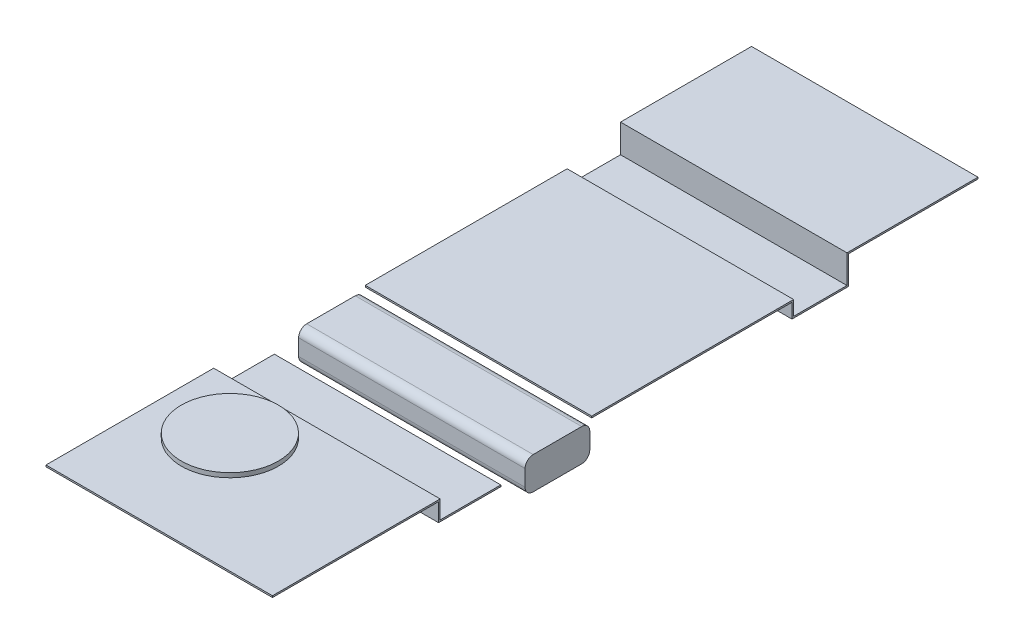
ISO-10303-21;
HEADER;
FILE_DESCRIPTION(('STEP AP214'),'2;1');
FILE_NAME('part.step','',(''),(''),'','','');
FILE_SCHEMA(('AUTOMOTIVE_DESIGN { 1 0 10303 214 1 1 1 1 }'));
ENDSEC;
DATA;
#1=APPLICATION_CONTEXT('core data for automotive mechanical design processes');
#2=APPLICATION_PROTOCOL_DEFINITION('international standard','automotive_design',2000,#1);
#3=PRODUCT_CONTEXT('',#1,'mechanical');
#4=PRODUCT('Part','Part','',(#3));
#5=PRODUCT_RELATED_PRODUCT_CATEGORY('part','',(#4));
#6=PRODUCT_DEFINITION_FORMATION('','',#4);
#7=PRODUCT_DEFINITION_CONTEXT('part definition',#1,'design');
#8=PRODUCT_DEFINITION('design','',#6,#7);
#9=PRODUCT_DEFINITION_SHAPE('','',#8);
#10=(LENGTH_UNIT() NAMED_UNIT(*) SI_UNIT(.MILLI.,.METRE.));
#11=(NAMED_UNIT(*) PLANE_ANGLE_UNIT() SI_UNIT($,.RADIAN.));
#12=(NAMED_UNIT(*) SI_UNIT($,.STERADIAN.) SOLID_ANGLE_UNIT());
#13=UNCERTAINTY_MEASURE_WITH_UNIT(LENGTH_MEASURE(1.E-05),#10,'distance_accuracy_value','');
#14=(GEOMETRIC_REPRESENTATION_CONTEXT(3) GLOBAL_UNCERTAINTY_ASSIGNED_CONTEXT((#13)) GLOBAL_UNIT_ASSIGNED_CONTEXT((#10,
#11,#12)) REPRESENTATION_CONTEXT('',''));
#15=CARTESIAN_POINT('',(0.,0.,0.));
#16=DIRECTION('',(0.,0.,1.));
#17=DIRECTION('',(1.,0.,0.));
#18=AXIS2_PLACEMENT_3D('',#15,#16,#17);
#19=CARTESIAN_POINT('',(-304.8,215.9,-374.65));
#20=DIRECTION('',(0.,1.,0.));
#21=DIRECTION('',(0.,0.,1.));
#22=AXIS2_PLACEMENT_3D('',#19,#20,#21);
#23=PLANE('',#22);
#24=CARTESIAN_POINT('',(-196.85,215.9,-292.1));
#25=DIRECTION('',(0.,1.,0.));
#26=DIRECTION('',(0.,0.,1.));
#27=AXIS2_PLACEMENT_3D('',#24,#25,#26);
#28=CIRCLE('',#27,76.2);
#29=CARTESIAN_POINT('',(-196.85,215.9,-368.3));
#30=VERTEX_POINT('',#29);
#31=EDGE_CURVE('E141',#30,#30,#28,.F.);
#32=ORIENTED_EDGE('',*,*,#31,.T.);
#33=EDGE_LOOP('',(#32));
#34=FACE_BOUND('',#33,.T.);
#35=DIRECTION('',(0.,0.,1.));
#36=VECTOR('',#35,1.);
#37=CARTESIAN_POINT('',(50.8,215.9,-374.65));
#38=LINE('',#37,#36);
#39=CARTESIAN_POINT('',(50.8,215.9,-374.65));
#40=VERTEX_POINT('',#39);
#41=CARTESIAN_POINT('',(50.8,215.9,-111.341361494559));
#42=VERTEX_POINT('',#41);
#43=EDGE_CURVE('E137',#40,#42,#38,.T.);
#44=ORIENTED_EDGE('',*,*,#43,.F.);
#45=DIRECTION('',(1.,0.,0.));
#46=VECTOR('',#45,1.);
#47=CARTESIAN_POINT('',(-304.8,215.9,-374.65));
#48=LINE('',#47,#46);
#49=CARTESIAN_POINT('',(-304.8,215.9,-374.65));
#50=VERTEX_POINT('',#49);
#51=EDGE_CURVE('E12',#50,#40,#48,.T.);
#52=ORIENTED_EDGE('',*,*,#51,.F.);
#53=DIRECTION('',(0.,0.,1.));
#54=VECTOR('',#53,1.);
#55=CARTESIAN_POINT('',(-304.8,215.9,-374.65));
#56=LINE('',#55,#54);
#57=CARTESIAN_POINT('',(-304.8,215.9,-111.341361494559));
#58=VERTEX_POINT('',#57);
#59=EDGE_CURVE('E155',#50,#58,#56,.T.);
#60=ORIENTED_EDGE('',*,*,#59,.T.);
#61=DIRECTION('',(1.,0.,0.));
#62=VECTOR('',#61,1.);
#63=CARTESIAN_POINT('',(-304.8,215.9,-111.341361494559));
#64=LINE('',#63,#62);
#65=EDGE_CURVE('E47',#58,#42,#64,.T.);
#66=ORIENTED_EDGE('',*,*,#65,.T.);
#67=EDGE_LOOP('',(#44,#52,#60,#66));
#68=FACE_BOUND('',#67,.T.);
#69=ADVANCED_FACE('F44',(#34,#68),#23,.T.);
#70=CARTESIAN_POINT('',(-304.8,187.325,-374.65));
#71=DIRECTION('',(0.,0.,-1.));
#72=DIRECTION('',(-1.,0.,0.));
#73=AXIS2_PLACEMENT_3D('',#70,#71,#72);
#74=PLANE('',#73);
#75=DIRECTION('',(0.,1.,0.));
#76=VECTOR('',#75,1.);
#77=CARTESIAN_POINT('',(50.8,187.325,-374.65));
#78=LINE('',#77,#76);
#79=CARTESIAN_POINT('',(50.8,187.325,-374.65));
#80=VERTEX_POINT('',#79);
#81=EDGE_CURVE('E153',#80,#40,#78,.T.);
#82=ORIENTED_EDGE('',*,*,#81,.F.);
#83=DIRECTION('',(1.,0.,0.));
#84=VECTOR('',#83,1.);
#85=CARTESIAN_POINT('',(-304.8,187.325,-374.65));
#86=LINE('',#85,#84);
#87=CARTESIAN_POINT('',(-304.8,187.325,-374.65));
#88=VERTEX_POINT('',#87);
#89=EDGE_CURVE('E53',#88,#80,#86,.T.);
#90=ORIENTED_EDGE('',*,*,#89,.F.);
#91=DIRECTION('',(0.,1.,0.));
#92=VECTOR('',#91,1.);
#93=CARTESIAN_POINT('',(-304.8,187.325,-374.65));
#94=LINE('',#93,#92);
#95=EDGE_CURVE('E132',#88,#50,#94,.T.);
#96=ORIENTED_EDGE('',*,*,#95,.T.);
#97=ORIENTED_EDGE('',*,*,#51,.T.);
#98=EDGE_LOOP('',(#82,#90,#96,#97));
#99=FACE_BOUND('',#98,.T.);
#100=ADVANCED_FACE('F173',(#99),#74,.T.);
#101=CARTESIAN_POINT('',(-304.8,187.325,-469.9));
#102=DIRECTION('',(0.,1.,0.));
#103=DIRECTION('',(0.,0.,1.));
#104=AXIS2_PLACEMENT_3D('',#101,#102,#103);
#105=PLANE('',#104);
#106=DIRECTION('',(0.,0.,1.));
#107=VECTOR('',#106,1.);
#108=CARTESIAN_POINT('',(50.8,187.325,-469.9));
#109=LINE('',#108,#107);
#110=CARTESIAN_POINT('',(50.8,187.325,-469.9));
#111=VERTEX_POINT('',#110);
#112=EDGE_CURVE('E119',#111,#80,#109,.T.);
#113=ORIENTED_EDGE('',*,*,#112,.F.);
#114=DIRECTION('',(1.,0.,0.));
#115=VECTOR('',#114,1.);
#116=CARTESIAN_POINT('',(-304.8,187.325,-469.9));
#117=LINE('',#116,#115);
#118=CARTESIAN_POINT('',(-304.8,187.325,-469.9));
#119=VERTEX_POINT('',#118);
#120=EDGE_CURVE('E113',#119,#111,#117,.T.);
#121=ORIENTED_EDGE('',*,*,#120,.F.);
#122=DIRECTION('',(0.,0.,1.));
#123=VECTOR('',#122,1.);
#124=CARTESIAN_POINT('',(-304.8,187.325,-469.9));
#125=LINE('',#124,#123);
#126=EDGE_CURVE('E117',#119,#88,#125,.T.);
#127=ORIENTED_EDGE('',*,*,#126,.T.);
#128=ORIENTED_EDGE('',*,*,#89,.T.);
#129=EDGE_LOOP('',(#113,#121,#127,#128));
#130=FACE_BOUND('',#129,.T.);
#131=ADVANCED_FACE('F115',(#130),#105,.T.);
#132=CARTESIAN_POINT('',(-304.8,187.325,-469.9));
#133=DIRECTION('',(0.,0.,1.));
#134=DIRECTION('',(1.,0.,0.));
#135=AXIS2_PLACEMENT_3D('',#132,#133,#134);
#136=PLANE('',#135);
#137=DIRECTION('',(0.,-1.,0.));
#138=VECTOR('',#137,1.);
#139=CARTESIAN_POINT('',(50.8,187.325,-469.9));
#140=LINE('',#139,#138);
#141=CARTESIAN_POINT('',(50.8,184.785,-469.9));
#142=VERTEX_POINT('',#141);
#143=EDGE_CURVE('E150',#111,#142,#140,.T.);
#144=ORIENTED_EDGE('',*,*,#143,.T.);
#145=DIRECTION('',(1.,0.,0.));
#146=VECTOR('',#145,1.);
#147=CARTESIAN_POINT('',(-304.8,184.785,-469.9));
#148=LINE('',#147,#146);
#149=CARTESIAN_POINT('',(-304.8,184.785,-469.9));
#150=VERTEX_POINT('',#149);
#151=EDGE_CURVE('E122',#150,#142,#148,.T.);
#152=ORIENTED_EDGE('',*,*,#151,.F.);
#153=DIRECTION('',(0.,-1.,0.));
#154=VECTOR('',#153,1.);
#155=CARTESIAN_POINT('',(-304.8,187.325,-469.9));
#156=LINE('',#155,#154);
#157=EDGE_CURVE('E125',#119,#150,#156,.T.);
#158=ORIENTED_EDGE('',*,*,#157,.F.);
#159=ORIENTED_EDGE('',*,*,#120,.T.);
#160=EDGE_LOOP('',(#144,#152,#158,#159));
#161=FACE_BOUND('',#160,.T.);
#162=ADVANCED_FACE('F126',(#161),#136,.F.);
#163=CARTESIAN_POINT('',(-304.8,184.785,-469.9));
#164=DIRECTION('',(0.,1.,0.));
#165=DIRECTION('',(0.,0.,1.));
#166=AXIS2_PLACEMENT_3D('',#163,#164,#165);
#167=PLANE('',#166);
#168=DIRECTION('',(0.,0.,-1.));
#169=VECTOR('',#168,1.);
#170=CARTESIAN_POINT('',(50.8,184.785,-469.9));
#171=LINE('',#170,#169);
#172=CARTESIAN_POINT('',(50.8,184.785,-372.11));
#173=VERTEX_POINT('',#172);
#174=EDGE_CURVE('E148',#142,#173,#171,.F.);
#175=ORIENTED_EDGE('',*,*,#174,.T.);
#176=DIRECTION('',(1.,0.,0.));
#177=VECTOR('',#176,1.);
#178=CARTESIAN_POINT('',(-304.8,184.785,-372.11));
#179=LINE('',#178,#177);
#180=CARTESIAN_POINT('',(-304.8,184.785,-372.11));
#181=VERTEX_POINT('',#180);
#182=EDGE_CURVE('E159',#181,#173,#179,.T.);
#183=ORIENTED_EDGE('',*,*,#182,.F.);
#184=DIRECTION('',(0.,0.,-1.));
#185=VECTOR('',#184,1.);
#186=CARTESIAN_POINT('',(-304.8,184.785,-469.9));
#187=LINE('',#186,#185);
#188=EDGE_CURVE('E129',#150,#181,#187,.F.);
#189=ORIENTED_EDGE('',*,*,#188,.F.);
#190=ORIENTED_EDGE('',*,*,#151,.T.);
#191=EDGE_LOOP('',(#175,#183,#189,#190));
#192=FACE_BOUND('',#191,.T.);
#193=ADVANCED_FACE('F188',(#192),#167,.F.);
#194=CARTESIAN_POINT('',(-304.8,187.325,-372.11));
#195=DIRECTION('',(0.,0.,-1.));
#196=DIRECTION('',(-1.,0.,0.));
#197=AXIS2_PLACEMENT_3D('',#194,#195,#196);
#198=PLANE('',#197);
#199=DIRECTION('',(0.,1.,0.));
#200=VECTOR('',#199,1.);
#201=CARTESIAN_POINT('',(50.8,187.325,-372.11));
#202=LINE('',#201,#200);
#203=CARTESIAN_POINT('',(50.8,213.36,-372.11));
#204=VERTEX_POINT('',#203);
#205=EDGE_CURVE('E146',#173,#204,#202,.T.);
#206=ORIENTED_EDGE('',*,*,#205,.T.);
#207=DIRECTION('',(1.,0.,0.));
#208=VECTOR('',#207,1.);
#209=CARTESIAN_POINT('',(-304.8,213.36,-372.11));
#210=LINE('',#209,#208);
#211=CARTESIAN_POINT('',(-304.8,213.36,-372.11));
#212=VERTEX_POINT('',#211);
#213=EDGE_CURVE('E162',#212,#204,#210,.T.);
#214=ORIENTED_EDGE('',*,*,#213,.F.);
#215=DIRECTION('',(0.,1.,0.));
#216=VECTOR('',#215,1.);
#217=CARTESIAN_POINT('',(-304.8,187.325,-372.11));
#218=LINE('',#217,#216);
#219=EDGE_CURVE('E229',#181,#212,#218,.T.);
#220=ORIENTED_EDGE('',*,*,#219,.F.);
#221=ORIENTED_EDGE('',*,*,#182,.T.);
#222=EDGE_LOOP('',(#206,#214,#220,#221));
#223=FACE_BOUND('',#222,.T.);
#224=ADVANCED_FACE('F191',(#223),#198,.F.);
#225=CARTESIAN_POINT('',(-304.8,213.36,-374.65));
#226=DIRECTION('',(0.,1.,0.));
#227=DIRECTION('',(0.,0.,1.));
#228=AXIS2_PLACEMENT_3D('',#225,#226,#227);
#229=PLANE('',#228);
#230=DIRECTION('',(0.,0.,-1.));
#231=VECTOR('',#230,1.);
#232=CARTESIAN_POINT('',(50.8,213.36,-374.65));
#233=LINE('',#232,#231);
#234=CARTESIAN_POINT('',(50.8,213.36,-111.341361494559));
#235=VERTEX_POINT('',#234);
#236=EDGE_CURVE('E144',#204,#235,#233,.F.);
#237=ORIENTED_EDGE('',*,*,#236,.T.);
#238=DIRECTION('',(1.,0.,0.));
#239=VECTOR('',#238,1.);
#240=CARTESIAN_POINT('',(-304.8,213.36,-111.341361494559));
#241=LINE('',#240,#239);
#242=CARTESIAN_POINT('',(-304.8,213.36,-111.341361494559));
#243=VERTEX_POINT('',#242);
#244=EDGE_CURVE('E164',#243,#235,#241,.T.);
#245=ORIENTED_EDGE('',*,*,#244,.F.);
#246=DIRECTION('',(0.,0.,-1.));
#247=VECTOR('',#246,1.);
#248=CARTESIAN_POINT('',(-304.8,213.36,-374.65));
#249=LINE('',#248,#247);
#250=EDGE_CURVE('E227',#212,#243,#249,.F.);
#251=ORIENTED_EDGE('',*,*,#250,.F.);
#252=ORIENTED_EDGE('',*,*,#213,.T.);
#253=EDGE_LOOP('',(#237,#245,#251,#252));
#254=FACE_BOUND('',#253,.T.);
#255=ADVANCED_FACE('F195',(#254),#229,.F.);
#256=CARTESIAN_POINT('',(-304.8,213.36,-111.341361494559));
#257=DIRECTION('',(0.,0.,-1.));
#258=DIRECTION('',(-1.,0.,0.));
#259=AXIS2_PLACEMENT_3D('',#256,#257,#258);
#260=PLANE('',#259);
#261=DIRECTION('',(0.,1.,0.));
#262=VECTOR('',#261,1.);
#263=CARTESIAN_POINT('',(50.8,213.36,-111.341361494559));
#264=LINE('',#263,#262);
#265=EDGE_CURVE('E140',#235,#42,#264,.T.);
#266=ORIENTED_EDGE('',*,*,#265,.T.);
#267=ORIENTED_EDGE('',*,*,#65,.F.);
#268=DIRECTION('',(0.,1.,0.));
#269=VECTOR('',#268,1.);
#270=CARTESIAN_POINT('',(-304.8,213.36,-111.341361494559));
#271=LINE('',#270,#269);
#272=EDGE_CURVE('E100',#243,#58,#271,.T.);
#273=ORIENTED_EDGE('',*,*,#272,.F.);
#274=ORIENTED_EDGE('',*,*,#244,.T.);
#275=EDGE_LOOP('',(#266,#267,#273,#274));
#276=FACE_BOUND('',#275,.T.);
#277=ADVANCED_FACE('F169',(#276),#260,.F.);
#278=CARTESIAN_POINT('',(-304.8,0.,0.));
#279=DIRECTION('',(-1.,0.,0.));
#280=DIRECTION('',(0.,0.,1.));
#281=AXIS2_PLACEMENT_3D('',#278,#279,#280);
#282=PLANE('',#281);
#283=ORIENTED_EDGE('',*,*,#59,.F.);
#284=ORIENTED_EDGE('',*,*,#95,.F.);
#285=ORIENTED_EDGE('',*,*,#126,.F.);
#286=ORIENTED_EDGE('',*,*,#157,.T.);
#287=ORIENTED_EDGE('',*,*,#188,.T.);
#288=ORIENTED_EDGE('',*,*,#219,.T.);
#289=ORIENTED_EDGE('',*,*,#250,.T.);
#290=ORIENTED_EDGE('',*,*,#272,.T.);
#291=EDGE_LOOP('',(#283,#284,#285,#286,#287,#288,#289,#290));
#292=FACE_BOUND('',#291,.T.);
#293=ADVANCED_FACE('F131',(#292),#282,.T.);
#294=CARTESIAN_POINT('',(50.8,0.,0.));
#295=DIRECTION('',(-1.,0.,0.));
#296=DIRECTION('',(0.,0.,1.));
#297=AXIS2_PLACEMENT_3D('',#294,#295,#296);
#298=PLANE('',#297);
#299=ORIENTED_EDGE('',*,*,#43,.T.);
#300=ORIENTED_EDGE('',*,*,#265,.F.);
#301=ORIENTED_EDGE('',*,*,#236,.F.);
#302=ORIENTED_EDGE('',*,*,#205,.F.);
#303=ORIENTED_EDGE('',*,*,#174,.F.);
#304=ORIENTED_EDGE('',*,*,#143,.F.);
#305=ORIENTED_EDGE('',*,*,#112,.T.);
#306=ORIENTED_EDGE('',*,*,#81,.T.);
#307=EDGE_LOOP('',(#299,#300,#301,#302,#303,#304,#305,#306));
#308=FACE_BOUND('',#307,.T.);
#309=ADVANCED_FACE('F172',(#308),#298,.F.);
#310=CARTESIAN_POINT('',(-196.85,222.885,-292.1));
#311=DIRECTION('',(0.,-1.,0.));
#312=DIRECTION('',(0.,0.,-1.));
#313=AXIS2_PLACEMENT_3D('',#310,#311,#312);
#314=CYLINDRICAL_SURFACE('',#313,76.2);
#315=CARTESIAN_POINT('',(-196.85,222.885,-292.1));
#316=DIRECTION('',(0.,1.,0.));
#317=DIRECTION('',(0.,0.,1.));
#318=AXIS2_PLACEMENT_3D('',#315,#316,#317);
#319=CIRCLE('',#318,76.2);
#320=CARTESIAN_POINT('',(-196.85,222.885,-368.3));
#321=VERTEX_POINT('',#320);
#322=EDGE_CURVE('E219',#321,#321,#319,.T.);
#323=CARTESIAN_POINT('',(-196.85,215.9,-368.3));
#324=CARTESIAN_POINT('',(-196.85,215.972760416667,-368.3));
#325=CARTESIAN_POINT('',(-196.85,216.045520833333,-368.3));
#326=CARTESIAN_POINT('',(-196.85,216.191041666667,-368.3));
#327=CARTESIAN_POINT('',(-196.85,216.263802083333,-368.3));
#328=CARTESIAN_POINT('',(-196.85,216.409322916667,-368.3));
#329=CARTESIAN_POINT('',(-196.85,216.482083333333,-368.3));
#330=CARTESIAN_POINT('',(-196.85,216.627604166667,-368.3));
#331=CARTESIAN_POINT('',(-196.85,216.700364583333,-368.3));
#332=CARTESIAN_POINT('',(-196.85,216.845885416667,-368.3));
#333=CARTESIAN_POINT('',(-196.85,216.918645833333,-368.3));
#334=CARTESIAN_POINT('',(-196.85,217.064166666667,-368.3));
#335=CARTESIAN_POINT('',(-196.85,217.136927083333,-368.3));
#336=CARTESIAN_POINT('',(-196.85,217.282447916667,-368.3));
#337=CARTESIAN_POINT('',(-196.85,217.355208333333,-368.3));
#338=CARTESIAN_POINT('',(-196.85,217.500729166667,-368.3));
#339=CARTESIAN_POINT('',(-196.85,217.573489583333,-368.3));
#340=CARTESIAN_POINT('',(-196.85,217.719010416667,-368.3));
#341=CARTESIAN_POINT('',(-196.85,217.791770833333,-368.3));
#342=CARTESIAN_POINT('',(-196.85,217.937291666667,-368.3));
#343=CARTESIAN_POINT('',(-196.85,218.010052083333,-368.3));
#344=CARTESIAN_POINT('',(-196.85,218.155572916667,-368.3));
#345=CARTESIAN_POINT('',(-196.85,218.228333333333,-368.3));
#346=CARTESIAN_POINT('',(-196.85,218.373854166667,-368.3));
#347=CARTESIAN_POINT('',(-196.85,218.446614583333,-368.3));
#348=CARTESIAN_POINT('',(-196.85,218.592135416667,-368.3));
#349=CARTESIAN_POINT('',(-196.85,218.664895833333,-368.3));
#350=CARTESIAN_POINT('',(-196.85,218.810416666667,-368.3));
#351=CARTESIAN_POINT('',(-196.85,218.883177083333,-368.3));
#352=CARTESIAN_POINT('',(-196.85,219.028697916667,-368.3));
#353=CARTESIAN_POINT('',(-196.85,219.101458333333,-368.3));
#354=CARTESIAN_POINT('',(-196.85,219.246979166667,-368.3));
#355=CARTESIAN_POINT('',(-196.85,219.319739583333,-368.3));
#356=CARTESIAN_POINT('',(-196.85,219.465260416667,-368.3));
#357=CARTESIAN_POINT('',(-196.85,219.538020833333,-368.3));
#358=CARTESIAN_POINT('',(-196.85,219.683541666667,-368.3));
#359=CARTESIAN_POINT('',(-196.85,219.756302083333,-368.3));
#360=CARTESIAN_POINT('',(-196.85,219.901822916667,-368.3));
#361=CARTESIAN_POINT('',(-196.85,219.974583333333,-368.3));
#362=CARTESIAN_POINT('',(-196.85,220.120104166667,-368.3));
#363=CARTESIAN_POINT('',(-196.85,220.192864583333,-368.3));
#364=CARTESIAN_POINT('',(-196.85,220.338385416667,-368.3));
#365=CARTESIAN_POINT('',(-196.85,220.411145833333,-368.3));
#366=CARTESIAN_POINT('',(-196.85,220.556666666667,-368.3));
#367=CARTESIAN_POINT('',(-196.85,220.629427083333,-368.3));
#368=CARTESIAN_POINT('',(-196.85,220.774947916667,-368.3));
#369=CARTESIAN_POINT('',(-196.85,220.847708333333,-368.3));
#370=CARTESIAN_POINT('',(-196.85,220.993229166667,-368.3));
#371=CARTESIAN_POINT('',(-196.85,221.065989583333,-368.3));
#372=CARTESIAN_POINT('',(-196.85,221.211510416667,-368.3));
#373=CARTESIAN_POINT('',(-196.85,221.284270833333,-368.3));
#374=CARTESIAN_POINT('',(-196.85,221.429791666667,-368.3));
#375=CARTESIAN_POINT('',(-196.85,221.502552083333,-368.3));
#376=CARTESIAN_POINT('',(-196.85,221.648072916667,-368.3));
#377=CARTESIAN_POINT('',(-196.85,221.720833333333,-368.3));
#378=CARTESIAN_POINT('',(-196.85,221.866354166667,-368.3));
#379=CARTESIAN_POINT('',(-196.85,221.939114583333,-368.3));
#380=CARTESIAN_POINT('',(-196.85,222.084635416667,-368.3));
#381=CARTESIAN_POINT('',(-196.85,222.157395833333,-368.3));
#382=CARTESIAN_POINT('',(-196.85,222.302916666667,-368.3));
#383=CARTESIAN_POINT('',(-196.85,222.375677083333,-368.3));
#384=CARTESIAN_POINT('',(-196.85,222.521197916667,-368.3));
#385=CARTESIAN_POINT('',(-196.85,222.593958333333,-368.3));
#386=CARTESIAN_POINT('',(-196.85,222.739479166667,-368.3));
#387=CARTESIAN_POINT('',(-196.85,222.812239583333,-368.3));
#388=CARTESIAN_POINT('',(-196.85,222.885,-368.3));
#389=B_SPLINE_CURVE_WITH_KNOTS('',3,(#323,#324,#325,#326,#327,#328,#329,#330,#331,#332,#333,
#334,#335,#336,#337,#338,#339,#340,#341,#342,#343,#344,#345,#346,#347,#348,#349,#350,#351,#352,
#353,#354,#355,#356,#357,#358,#359,#360,#361,#362,#363,#364,#365,#366,#367,#368,#369,#370,#371,
#372,#373,#374,#375,#376,#377,#378,#379,#380,#381,#382,#383,#384,#385,#386,#387,#388),
.UNSPECIFIED.,.F.,.F.,(4,2,2,2,2,2,2,2,2,2,2,2,2,2,2,2,2,2,2,2,2,2,2,2,2,2,2,2,2,2,2,2,4),(0.,
0.218281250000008,0.436562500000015,0.654843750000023,0.873125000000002,1.09140625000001,
1.30968750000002,1.52796875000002,1.74625,1.96453125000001,2.18281250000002,2.40109375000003,
2.61937500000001,2.83765625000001,3.05593750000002,3.27421875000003,3.49250000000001,
3.71078125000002,3.92906250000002,4.14734375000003,4.36562500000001,4.58390625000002,
4.80218750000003,5.02046875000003,5.23875000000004,5.45703125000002,5.67531250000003,
5.89359375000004,6.11187500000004,6.33015625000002,6.54843750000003,6.76671875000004,
6.98500000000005),.UNSPECIFIED.);
#390=EDGE_CURVE('BSEAM207',#30,#321,#389,.T.);
#391=ORIENTED_EDGE('',*,*,#31,.F.);
#392=ORIENTED_EDGE('',*,*,#322,.F.);
#393=ORIENTED_EDGE('',*,*,#390,.T.);
#394=ORIENTED_EDGE('',*,*,#390,.F.);
#395=EDGE_LOOP('',(#391,#393,#392,#394));
#396=FACE_BOUND('',#395,.T.);
#397=ADVANCED_FACE('F207',(#396),#314,.T.);
#398=CARTESIAN_POINT('',(-196.85,222.885,-292.1));
#399=DIRECTION('',(0.,1.,0.));
#400=DIRECTION('',(0.,0.,1.));
#401=AXIS2_PLACEMENT_3D('',#398,#399,#400);
#402=PLANE('',#401);
#403=ORIENTED_EDGE('',*,*,#322,.T.);
#404=EDGE_LOOP('',(#403));
#405=FACE_BOUND('',#404,.T.);
#406=ADVANCED_FACE('F211',(#405),#402,.T.);
#407=CLOSED_SHELL('',(#69,#100,#131,#162,#193,#224,#255,#277,#293,#309,#397,#406));
#408=MANIFOLD_SOLID_BREP('B2',#407);
#409=CARTESIAN_POINT('',(-304.8,228.6,-1016.));
#410=DIRECTION('',(0.,-1.,0.));
#411=DIRECTION('',(0.,0.,-1.));
#412=AXIS2_PLACEMENT_3D('',#409,#410,#411);
#413=PLANE('',#412);
#414=DIRECTION('',(0.,0.,-1.));
#415=VECTOR('',#414,1.);
#416=CARTESIAN_POINT('',(50.8,228.6,-1016.));
#417=LINE('',#416,#415);
#418=CARTESIAN_POINT('',(50.8,228.6,-1016.));
#419=VERTEX_POINT('',#418);
#420=CARTESIAN_POINT('',(50.8,228.6,-1219.2));
#421=VERTEX_POINT('',#420);
#422=EDGE_CURVE('E430',#419,#421,#417,.T.);
#423=ORIENTED_EDGE('',*,*,#422,.F.);
#424=DIRECTION('',(1.,0.,0.));
#425=VECTOR('',#424,1.);
#426=CARTESIAN_POINT('',(-304.8,228.6,-1016.));
#427=LINE('',#426,#425);
#428=CARTESIAN_POINT('',(-304.8,228.6,-1016.));
#429=VERTEX_POINT('',#428);
#430=EDGE_CURVE('E42',#429,#419,#427,.T.);
#431=ORIENTED_EDGE('',*,*,#430,.F.);
#432=DIRECTION('',(0.,0.,-1.));
#433=VECTOR('',#432,1.);
#434=CARTESIAN_POINT('',(-304.8,228.6,-1016.));
#435=LINE('',#434,#433);
#436=CARTESIAN_POINT('',(-304.8,228.6,-1219.2));
#437=VERTEX_POINT('',#436);
#438=EDGE_CURVE('E456',#429,#437,#435,.T.);
#439=ORIENTED_EDGE('',*,*,#438,.T.);
#440=DIRECTION('',(1.,0.,0.));
#441=VECTOR('',#440,1.);
#442=CARTESIAN_POINT('',(-304.8,228.6,-1219.2));
#443=LINE('',#442,#441);
#444=EDGE_CURVE('E313',#437,#421,#443,.T.);
#445=ORIENTED_EDGE('',*,*,#444,.T.);
#446=EDGE_LOOP('',(#423,#431,#439,#445));
#447=FACE_BOUND('',#446,.T.);
#448=ADVANCED_FACE('F310',(#447),#413,.T.);
#449=CARTESIAN_POINT('',(-304.8,184.15,-1016.));
#450=DIRECTION('',(0.,0.,-1.));
#451=DIRECTION('',(-1.,0.,0.));
#452=AXIS2_PLACEMENT_3D('',#449,#450,#451);
#453=PLANE('',#452);
#454=DIRECTION('',(0.,1.,0.));
#455=VECTOR('',#454,1.);
#456=CARTESIAN_POINT('',(50.8,184.15,-1016.));
#457=LINE('',#456,#455);
#458=CARTESIAN_POINT('',(50.8,184.15,-1016.));
#459=VERTEX_POINT('',#458);
#460=EDGE_CURVE('E454',#459,#419,#457,.T.);
#461=ORIENTED_EDGE('',*,*,#460,.F.);
#462=DIRECTION('',(1.,0.,0.));
#463=VECTOR('',#462,1.);
#464=CARTESIAN_POINT('',(-304.8,184.15,-1016.));
#465=LINE('',#464,#463);
#466=CARTESIAN_POINT('',(-304.8,184.15,-1016.));
#467=VERTEX_POINT('',#466);
#468=EDGE_CURVE('E319',#467,#459,#465,.T.);
#469=ORIENTED_EDGE('',*,*,#468,.F.);
#470=DIRECTION('',(0.,1.,0.));
#471=VECTOR('',#470,1.);
#472=CARTESIAN_POINT('',(-304.8,184.15,-1016.));
#473=LINE('',#472,#471);
#474=EDGE_CURVE('E420',#467,#429,#473,.T.);
#475=ORIENTED_EDGE('',*,*,#474,.T.);
#476=ORIENTED_EDGE('',*,*,#430,.T.);
#477=EDGE_LOOP('',(#461,#469,#475,#476));
#478=FACE_BOUND('',#477,.T.);
#479=ADVANCED_FACE('F485',(#478),#453,.T.);
#480=CARTESIAN_POINT('',(-304.8,184.15,-927.1));
#481=DIRECTION('',(0.,-1.,0.));
#482=DIRECTION('',(0.,0.,-1.));
#483=AXIS2_PLACEMENT_3D('',#480,#481,#482);
#484=PLANE('',#483);
#485=DIRECTION('',(0.,0.,-1.));
#486=VECTOR('',#485,1.);
#487=CARTESIAN_POINT('',(50.8,184.15,-927.1));
#488=LINE('',#487,#486);
#489=CARTESIAN_POINT('',(50.8,184.15,-927.1));
#490=VERTEX_POINT('',#489);
#491=EDGE_CURVE('E408',#490,#459,#488,.T.);
#492=ORIENTED_EDGE('',*,*,#491,.F.);
#493=DIRECTION('',(1.,0.,0.));
#494=VECTOR('',#493,1.);
#495=CARTESIAN_POINT('',(-304.8,184.15,-927.1));
#496=LINE('',#495,#494);
#497=CARTESIAN_POINT('',(-304.8,184.15,-927.1));
#498=VERTEX_POINT('',#497);
#499=EDGE_CURVE('E403',#498,#490,#496,.T.);
#500=ORIENTED_EDGE('',*,*,#499,.F.);
#501=DIRECTION('',(0.,0.,-1.));
#502=VECTOR('',#501,1.);
#503=CARTESIAN_POINT('',(-304.8,184.15,-927.1));
#504=LINE('',#503,#502);
#505=EDGE_CURVE('E406',#498,#467,#504,.T.);
#506=ORIENTED_EDGE('',*,*,#505,.T.);
#507=ORIENTED_EDGE('',*,*,#468,.T.);
#508=EDGE_LOOP('',(#492,#500,#506,#507));
#509=FACE_BOUND('',#508,.T.);
#510=ADVANCED_FACE('F405',(#509),#484,.T.);
#511=CARTESIAN_POINT('',(-304.8,207.01,-927.1));
#512=DIRECTION('',(0.,0.,1.));
#513=DIRECTION('',(1.,0.,0.));
#514=AXIS2_PLACEMENT_3D('',#511,#512,#513);
#515=PLANE('',#514);
#516=DIRECTION('',(0.,-1.,0.));
#517=VECTOR('',#516,1.);
#518=CARTESIAN_POINT('',(50.8,207.01,-927.1));
#519=LINE('',#518,#517);
#520=CARTESIAN_POINT('',(50.8,207.01,-927.1));
#521=VERTEX_POINT('',#520);
#522=EDGE_CURVE('E451',#521,#490,#519,.T.);
#523=ORIENTED_EDGE('',*,*,#522,.F.);
#524=DIRECTION('',(1.,0.,0.));
#525=VECTOR('',#524,1.);
#526=CARTESIAN_POINT('',(-304.8,207.01,-927.1));
#527=LINE('',#526,#525);
#528=CARTESIAN_POINT('',(-304.8,207.01,-927.1));
#529=VERTEX_POINT('',#528);
#530=EDGE_CURVE('E413',#529,#521,#527,.T.);
#531=ORIENTED_EDGE('',*,*,#530,.F.);
#532=DIRECTION('',(0.,-1.,0.));
#533=VECTOR('',#532,1.);
#534=CARTESIAN_POINT('',(-304.8,207.01,-927.1));
#535=LINE('',#534,#533);
#536=EDGE_CURVE('E418',#529,#498,#535,.T.);
#537=ORIENTED_EDGE('',*,*,#536,.T.);
#538=ORIENTED_EDGE('',*,*,#499,.T.);
#539=EDGE_LOOP('',(#523,#531,#537,#538));
#540=FACE_BOUND('',#539,.T.);
#541=ADVANCED_FACE('F422',(#540),#515,.T.);
#542=CARTESIAN_POINT('',(-304.8,207.01,-612.668806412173));
#543=DIRECTION('',(0.,-1.,0.));
#544=DIRECTION('',(0.,0.,-1.));
#545=AXIS2_PLACEMENT_3D('',#542,#543,#544);
#546=PLANE('',#545);
#547=DIRECTION('',(0.,0.,-1.));
#548=VECTOR('',#547,1.);
#549=CARTESIAN_POINT('',(50.8,207.01,-612.668806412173));
#550=LINE('',#549,#548);
#551=CARTESIAN_POINT('',(50.8,207.01,-612.668806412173));
#552=VERTEX_POINT('',#551);
#553=EDGE_CURVE('E448',#552,#521,#550,.T.);
#554=ORIENTED_EDGE('',*,*,#553,.F.);
#555=DIRECTION('',(1.,0.,0.));
#556=VECTOR('',#555,1.);
#557=CARTESIAN_POINT('',(-304.8,207.01,-612.668806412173));
#558=LINE('',#557,#556);
#559=CARTESIAN_POINT('',(-304.8,207.01,-612.668806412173));
#560=VERTEX_POINT('',#559);
#561=EDGE_CURVE('E460',#560,#552,#558,.T.);
#562=ORIENTED_EDGE('',*,*,#561,.F.);
#563=DIRECTION('',(0.,0.,-1.));
#564=VECTOR('',#563,1.);
#565=CARTESIAN_POINT('',(-304.8,207.01,-612.668806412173));
#566=LINE('',#565,#564);
#567=EDGE_CURVE('E423',#560,#529,#566,.T.);
#568=ORIENTED_EDGE('',*,*,#567,.T.);
#569=ORIENTED_EDGE('',*,*,#530,.T.);
#570=EDGE_LOOP('',(#554,#562,#568,#569));
#571=FACE_BOUND('',#570,.T.);
#572=ADVANCED_FACE('F498',(#571),#546,.T.);
#573=CARTESIAN_POINT('',(-304.8,207.01,-612.668806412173));
#574=DIRECTION('',(0.,0.,-1.));
#575=DIRECTION('',(-1.,0.,0.));
#576=AXIS2_PLACEMENT_3D('',#573,#574,#575);
#577=PLANE('',#576);
#578=DIRECTION('',(0.,1.,0.));
#579=VECTOR('',#578,1.);
#580=CARTESIAN_POINT('',(50.8,207.01,-612.668806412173));
#581=LINE('',#580,#579);
#582=CARTESIAN_POINT('',(50.8,209.55,-612.668806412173));
#583=VERTEX_POINT('',#582);
#584=EDGE_CURVE('E446',#552,#583,#581,.T.);
#585=ORIENTED_EDGE('',*,*,#584,.T.);
#586=DIRECTION('',(1.,0.,0.));
#587=VECTOR('',#586,1.);
#588=CARTESIAN_POINT('',(-304.8,209.55,-612.668806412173));
#589=LINE('',#588,#587);
#590=CARTESIAN_POINT('',(-304.8,209.55,-612.668806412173));
#591=VERTEX_POINT('',#590);
#592=EDGE_CURVE('E462',#591,#583,#589,.T.);
#593=ORIENTED_EDGE('',*,*,#592,.F.);
#594=DIRECTION('',(0.,1.,0.));
#595=VECTOR('',#594,1.);
#596=CARTESIAN_POINT('',(-304.8,207.01,-612.668806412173));
#597=LINE('',#596,#595);
#598=EDGE_CURVE('E425',#560,#591,#597,.T.);
#599=ORIENTED_EDGE('',*,*,#598,.F.);
#600=ORIENTED_EDGE('',*,*,#561,.T.);
#601=EDGE_LOOP('',(#585,#593,#599,#600));
#602=FACE_BOUND('',#601,.T.);
#603=ADVANCED_FACE('F501',(#602),#577,.F.);
#604=CARTESIAN_POINT('',(-304.8,209.55,-612.668806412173));
#605=DIRECTION('',(0.,-1.,0.));
#606=DIRECTION('',(0.,0.,-1.));
#607=AXIS2_PLACEMENT_3D('',#604,#605,#606);
#608=PLANE('',#607);
#609=DIRECTION('',(0.,0.,-1.));
#610=VECTOR('',#609,1.);
#611=CARTESIAN_POINT('',(50.8,209.55,-612.668806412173));
#612=LINE('',#611,#610);
#613=CARTESIAN_POINT('',(50.8,209.55,-929.64));
#614=VERTEX_POINT('',#613);
#615=EDGE_CURVE('E444',#583,#614,#612,.T.);
#616=ORIENTED_EDGE('',*,*,#615,.T.);
#617=DIRECTION('',(1.,0.,0.));
#618=VECTOR('',#617,1.);
#619=CARTESIAN_POINT('',(-304.8,209.55,-929.64));
#620=LINE('',#619,#618);
#621=CARTESIAN_POINT('',(-304.8,209.55,-929.64));
#622=VERTEX_POINT('',#621);
#623=EDGE_CURVE('E465',#622,#614,#620,.T.);
#624=ORIENTED_EDGE('',*,*,#623,.F.);
#625=DIRECTION('',(0.,0.,-1.));
#626=VECTOR('',#625,1.);
#627=CARTESIAN_POINT('',(-304.8,209.55,-612.668806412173));
#628=LINE('',#627,#626);
#629=EDGE_CURVE('E629',#591,#622,#628,.T.);
#630=ORIENTED_EDGE('',*,*,#629,.F.);
#631=ORIENTED_EDGE('',*,*,#592,.T.);
#632=EDGE_LOOP('',(#616,#624,#630,#631));
#633=FACE_BOUND('',#632,.T.);
#634=ADVANCED_FACE('F505',(#633),#608,.F.);
#635=CARTESIAN_POINT('',(-304.8,207.01,-929.64));
#636=DIRECTION('',(0.,0.,1.));
#637=DIRECTION('',(1.,0.,0.));
#638=AXIS2_PLACEMENT_3D('',#635,#636,#637);
#639=PLANE('',#638);
#640=DIRECTION('',(0.,1.,0.));
#641=VECTOR('',#640,1.);
#642=CARTESIAN_POINT('',(50.8,207.01,-929.64));
#643=LINE('',#642,#641);
#644=CARTESIAN_POINT('',(50.8,186.69,-929.64));
#645=VERTEX_POINT('',#644);
#646=EDGE_CURVE('E442',#614,#645,#643,.F.);
#647=ORIENTED_EDGE('',*,*,#646,.T.);
#648=DIRECTION('',(1.,0.,0.));
#649=VECTOR('',#648,1.);
#650=CARTESIAN_POINT('',(-304.8,186.69,-929.64));
#651=LINE('',#650,#649);
#652=CARTESIAN_POINT('',(-304.8,186.69,-929.64));
#653=VERTEX_POINT('',#652);
#654=EDGE_CURVE('E468',#653,#645,#651,.T.);
#655=ORIENTED_EDGE('',*,*,#654,.F.);
#656=DIRECTION('',(0.,1.,0.));
#657=VECTOR('',#656,1.);
#658=CARTESIAN_POINT('',(-304.8,207.01,-929.64));
#659=LINE('',#658,#657);
#660=EDGE_CURVE('E622',#622,#653,#659,.F.);
#661=ORIENTED_EDGE('',*,*,#660,.F.);
#662=ORIENTED_EDGE('',*,*,#623,.T.);
#663=EDGE_LOOP('',(#647,#655,#661,#662));
#664=FACE_BOUND('',#663,.T.);
#665=ADVANCED_FACE('F509',(#664),#639,.F.);
#666=CARTESIAN_POINT('',(-304.8,186.69,-927.1));
#667=DIRECTION('',(0.,-1.,0.));
#668=DIRECTION('',(0.,0.,-1.));
#669=AXIS2_PLACEMENT_3D('',#666,#667,#668);
#670=PLANE('',#669);
#671=DIRECTION('',(0.,0.,-1.));
#672=VECTOR('',#671,1.);
#673=CARTESIAN_POINT('',(50.8,186.69,-927.1));
#674=LINE('',#673,#672);
#675=CARTESIAN_POINT('',(50.8,186.69,-1013.46));
#676=VERTEX_POINT('',#675);
#677=EDGE_CURVE('E440',#645,#676,#674,.T.);
#678=ORIENTED_EDGE('',*,*,#677,.T.);
#679=DIRECTION('',(1.,0.,0.));
#680=VECTOR('',#679,1.);
#681=CARTESIAN_POINT('',(-304.8,186.69,-1013.46));
#682=LINE('',#681,#680);
#683=CARTESIAN_POINT('',(-304.8,186.69,-1013.46));
#684=VERTEX_POINT('',#683);
#685=EDGE_CURVE('E471',#684,#676,#682,.T.);
#686=ORIENTED_EDGE('',*,*,#685,.F.);
#687=DIRECTION('',(0.,0.,-1.));
#688=VECTOR('',#687,1.);
#689=CARTESIAN_POINT('',(-304.8,186.69,-927.1));
#690=LINE('',#689,#688);
#691=EDGE_CURVE('E619',#653,#684,#690,.T.);
#692=ORIENTED_EDGE('',*,*,#691,.F.);
#693=ORIENTED_EDGE('',*,*,#654,.T.);
#694=EDGE_LOOP('',(#678,#686,#692,#693));
#695=FACE_BOUND('',#694,.T.);
#696=ADVANCED_FACE('F513',(#695),#670,.F.);
#697=CARTESIAN_POINT('',(-304.8,184.15,-1013.46));
#698=DIRECTION('',(0.,0.,-1.));
#699=DIRECTION('',(-1.,0.,0.));
#700=AXIS2_PLACEMENT_3D('',#697,#698,#699);
#701=PLANE('',#700);
#702=DIRECTION('',(0.,1.,0.));
#703=VECTOR('',#702,1.);
#704=CARTESIAN_POINT('',(50.8,184.15,-1013.46));
#705=LINE('',#704,#703);
#706=CARTESIAN_POINT('',(50.8,231.14,-1013.46));
#707=VERTEX_POINT('',#706);
#708=EDGE_CURVE('E438',#676,#707,#705,.T.);
#709=ORIENTED_EDGE('',*,*,#708,.T.);
#710=DIRECTION('',(1.,0.,0.));
#711=VECTOR('',#710,1.);
#712=CARTESIAN_POINT('',(-304.8,231.14,-1013.46));
#713=LINE('',#712,#711);
#714=CARTESIAN_POINT('',(-304.8,231.14,-1013.46));
#715=VERTEX_POINT('',#714);
#716=EDGE_CURVE('E474',#715,#707,#713,.T.);
#717=ORIENTED_EDGE('',*,*,#716,.F.);
#718=DIRECTION('',(0.,1.,0.));
#719=VECTOR('',#718,1.);
#720=CARTESIAN_POINT('',(-304.8,184.15,-1013.46));
#721=LINE('',#720,#719);
#722=EDGE_CURVE('E617',#684,#715,#721,.T.);
#723=ORIENTED_EDGE('',*,*,#722,.F.);
#724=ORIENTED_EDGE('',*,*,#685,.T.);
#725=EDGE_LOOP('',(#709,#717,#723,#724));
#726=FACE_BOUND('',#725,.T.);
#727=ADVANCED_FACE('F517',(#726),#701,.F.);
#728=CARTESIAN_POINT('',(-304.8,231.14,-1016.));
#729=DIRECTION('',(0.,-1.,0.));
#730=DIRECTION('',(0.,0.,-1.));
#731=AXIS2_PLACEMENT_3D('',#728,#729,#730);
#732=PLANE('',#731);
#733=DIRECTION('',(0.,0.,-1.));
#734=VECTOR('',#733,1.);
#735=CARTESIAN_POINT('',(50.8,231.14,-1016.));
#736=LINE('',#735,#734);
#737=CARTESIAN_POINT('',(50.8,231.14,-1219.2));
#738=VERTEX_POINT('',#737);
#739=EDGE_CURVE('E436',#707,#738,#736,.T.);
#740=ORIENTED_EDGE('',*,*,#739,.T.);
#741=DIRECTION('',(1.,0.,0.));
#742=VECTOR('',#741,1.);
#743=CARTESIAN_POINT('',(-304.8,231.14,-1219.2));
#744=LINE('',#743,#742);
#745=CARTESIAN_POINT('',(-304.8,231.14,-1219.2));
#746=VERTEX_POINT('',#745);
#747=EDGE_CURVE('E476',#746,#738,#744,.T.);
#748=ORIENTED_EDGE('',*,*,#747,.F.);
#749=DIRECTION('',(0.,0.,-1.));
#750=VECTOR('',#749,1.);
#751=CARTESIAN_POINT('',(-304.8,231.14,-1016.));
#752=LINE('',#751,#750);
#753=EDGE_CURVE('E636',#715,#746,#752,.T.);
#754=ORIENTED_EDGE('',*,*,#753,.F.);
#755=ORIENTED_EDGE('',*,*,#716,.T.);
#756=EDGE_LOOP('',(#740,#748,#754,#755));
#757=FACE_BOUND('',#756,.T.);
#758=ADVANCED_FACE('F521',(#757),#732,.F.);
#759=CARTESIAN_POINT('',(-304.8,231.14,-1219.2));
#760=DIRECTION('',(0.,0.,1.));
#761=DIRECTION('',(1.,0.,0.));
#762=AXIS2_PLACEMENT_3D('',#759,#760,#761);
#763=PLANE('',#762);
#764=DIRECTION('',(0.,-1.,0.));
#765=VECTOR('',#764,1.);
#766=CARTESIAN_POINT('',(50.8,231.14,-1219.2));
#767=LINE('',#766,#765);
#768=EDGE_CURVE('E433',#738,#421,#767,.T.);
#769=ORIENTED_EDGE('',*,*,#768,.T.);
#770=ORIENTED_EDGE('',*,*,#444,.F.);
#771=DIRECTION('',(0.,-1.,0.));
#772=VECTOR('',#771,1.);
#773=CARTESIAN_POINT('',(-304.8,231.14,-1219.2));
#774=LINE('',#773,#772);
#775=EDGE_CURVE('E378',#746,#437,#774,.T.);
#776=ORIENTED_EDGE('',*,*,#775,.F.);
#777=ORIENTED_EDGE('',*,*,#747,.T.);
#778=EDGE_LOOP('',(#769,#770,#776,#777));
#779=FACE_BOUND('',#778,.T.);
#780=ADVANCED_FACE('F481',(#779),#763,.F.);
#781=CARTESIAN_POINT('',(-304.8,0.,0.));
#782=DIRECTION('',(-1.,0.,0.));
#783=DIRECTION('',(0.,0.,1.));
#784=AXIS2_PLACEMENT_3D('',#781,#782,#783);
#785=PLANE('',#784);
#786=ORIENTED_EDGE('',*,*,#438,.F.);
#787=ORIENTED_EDGE('',*,*,#474,.F.);
#788=ORIENTED_EDGE('',*,*,#505,.F.);
#789=ORIENTED_EDGE('',*,*,#536,.F.);
#790=ORIENTED_EDGE('',*,*,#567,.F.);
#791=ORIENTED_EDGE('',*,*,#598,.T.);
#792=ORIENTED_EDGE('',*,*,#629,.T.);
#793=ORIENTED_EDGE('',*,*,#660,.T.);
#794=ORIENTED_EDGE('',*,*,#691,.T.);
#795=ORIENTED_EDGE('',*,*,#722,.T.);
#796=ORIENTED_EDGE('',*,*,#753,.T.);
#797=ORIENTED_EDGE('',*,*,#775,.T.);
#798=EDGE_LOOP('',(#786,#787,#788,#789,#790,#791,#792,#793,#794,#795,#796,#797));
#799=FACE_BOUND('',#798,.T.);
#800=ADVANCED_FACE('F416',(#799),#785,.T.);
#801=CARTESIAN_POINT('',(50.8,0.,0.));
#802=DIRECTION('',(-1.,0.,0.));
#803=DIRECTION('',(0.,0.,1.));
#804=AXIS2_PLACEMENT_3D('',#801,#802,#803);
#805=PLANE('',#804);
#806=ORIENTED_EDGE('',*,*,#422,.T.);
#807=ORIENTED_EDGE('',*,*,#768,.F.);
#808=ORIENTED_EDGE('',*,*,#739,.F.);
#809=ORIENTED_EDGE('',*,*,#708,.F.);
#810=ORIENTED_EDGE('',*,*,#677,.F.);
#811=ORIENTED_EDGE('',*,*,#646,.F.);
#812=ORIENTED_EDGE('',*,*,#615,.F.);
#813=ORIENTED_EDGE('',*,*,#584,.F.);
#814=ORIENTED_EDGE('',*,*,#553,.T.);
#815=ORIENTED_EDGE('',*,*,#522,.T.);
#816=ORIENTED_EDGE('',*,*,#491,.T.);
#817=ORIENTED_EDGE('',*,*,#460,.T.);
#818=EDGE_LOOP('',(#806,#807,#808,#809,#810,#811,#812,#813,#814,#815,#816,#817));
#819=FACE_BOUND('',#818,.T.);
#820=ADVANCED_FACE('F484',(#819),#805,.F.);
#821=CLOSED_SHELL('',(#448,#479,#510,#541,#572,#603,#634,#665,#696,#727,#758,#780,#800,#820));
#822=MANIFOLD_SOLID_BREP('B6',#821);
#823=CARTESIAN_POINT('',(-304.8,203.2,-508.));
#824=DIRECTION('',(0.,0.,1.));
#825=DIRECTION('',(1.,0.,0.));
#826=AXIS2_PLACEMENT_3D('',#823,#824,#825);
#827=PLANE('',#826);
#828=DIRECTION('',(0.,-1.,0.));
#829=VECTOR('',#828,1.);
#830=CARTESIAN_POINT('',(-304.8,203.2,-508.));
#831=LINE('',#830,#829);
#832=CARTESIAN_POINT('',(-304.8,190.5,-508.));
#833=VERTEX_POINT('',#832);
#834=CARTESIAN_POINT('',(-304.8,165.1,-508.));
#835=VERTEX_POINT('',#834);
#836=EDGE_CURVE('E763',#833,#835,#831,.T.);
#837=ORIENTED_EDGE('',*,*,#836,.T.);
#838=DIRECTION('',(1.,0.,0.));
#839=VECTOR('',#838,1.);
#840=CARTESIAN_POINT('',(-304.8,165.1,-508.));
#841=LINE('',#840,#839);
#842=CARTESIAN_POINT('',(50.8,165.1,-508.));
#843=VERTEX_POINT('',#842);
#844=EDGE_CURVE('E308',#835,#843,#841,.T.);
#845=ORIENTED_EDGE('',*,*,#844,.T.);
#846=DIRECTION('',(0.,-1.,0.));
#847=VECTOR('',#846,1.);
#848=CARTESIAN_POINT('',(50.8,203.2,-508.));
#849=LINE('',#848,#847);
#850=CARTESIAN_POINT('',(50.8,190.5,-508.));
#851=VERTEX_POINT('',#850);
#852=EDGE_CURVE('E713',#851,#843,#849,.T.);
#853=ORIENTED_EDGE('',*,*,#852,.F.);
#854=DIRECTION('',(1.,0.,0.));
#855=VECTOR('',#854,1.);
#856=CARTESIAN_POINT('',(-304.8,190.5,-508.));
#857=LINE('',#856,#855);
#858=EDGE_CURVE('E649',#851,#833,#857,.F.);
#859=ORIENTED_EDGE('',*,*,#858,.T.);
#860=EDGE_LOOP('',(#837,#845,#853,#859));
#861=FACE_BOUND('',#860,.T.);
#862=ADVANCED_FACE('F641',(#861),#827,.T.);
#863=CARTESIAN_POINT('',(-304.8,203.2,-508.));
#864=DIRECTION('',(0.,1.,0.));
#865=DIRECTION('',(0.,0.,1.));
#866=AXIS2_PLACEMENT_3D('',#863,#864,#865);
#867=PLANE('',#866);
#868=DIRECTION('',(0.,0.,1.));
#869=VECTOR('',#868,1.);
#870=CARTESIAN_POINT('',(50.8,203.2,-508.));
#871=LINE('',#870,#869);
#872=CARTESIAN_POINT('',(50.8,203.2,-596.9));
#873=VERTEX_POINT('',#872);
#874=CARTESIAN_POINT('',(50.8,203.2,-520.7));
#875=VERTEX_POINT('',#874);
#876=EDGE_CURVE('E739',#873,#875,#871,.T.);
#877=ORIENTED_EDGE('',*,*,#876,.F.);
#878=DIRECTION('',(1.,0.,0.));
#879=VECTOR('',#878,1.);
#880=CARTESIAN_POINT('',(-304.8,203.2,-596.9));
#881=LINE('',#880,#879);
#882=CARTESIAN_POINT('',(-304.8,203.2,-596.9));
#883=VERTEX_POINT('',#882);
#884=EDGE_CURVE('E663',#873,#883,#881,.F.);
#885=ORIENTED_EDGE('',*,*,#884,.T.);
#886=DIRECTION('',(0.,0.,1.));
#887=VECTOR('',#886,1.);
#888=CARTESIAN_POINT('',(-304.8,203.2,-508.));
#889=LINE('',#888,#887);
#890=CARTESIAN_POINT('',(-304.8,203.2,-520.7));
#891=VERTEX_POINT('',#890);
#892=EDGE_CURVE('E733',#883,#891,#889,.T.);
#893=ORIENTED_EDGE('',*,*,#892,.T.);
#894=DIRECTION('',(1.,0.,0.));
#895=VECTOR('',#894,1.);
#896=CARTESIAN_POINT('',(-304.8,203.2,-520.7));
#897=LINE('',#896,#895);
#898=EDGE_CURVE('E757',#891,#875,#897,.T.);
#899=ORIENTED_EDGE('',*,*,#898,.T.);
#900=EDGE_LOOP('',(#877,#885,#893,#899));
#901=FACE_BOUND('',#900,.T.);
#902=ADVANCED_FACE('F771',(#901),#867,.T.);
#903=CARTESIAN_POINT('',(-304.8,203.2,-609.6));
#904=DIRECTION('',(0.,0.,-1.));
#905=DIRECTION('',(-1.,0.,0.));
#906=AXIS2_PLACEMENT_3D('',#903,#904,#905);
#907=PLANE('',#906);
#908=DIRECTION('',(0.,1.,0.));
#909=VECTOR('',#908,1.);
#910=CARTESIAN_POINT('',(50.8,203.2,-609.6));
#911=LINE('',#910,#909);
#912=CARTESIAN_POINT('',(50.8,165.1,-609.6));
#913=VERTEX_POINT('',#912);
#914=CARTESIAN_POINT('',(50.8,190.5,-609.6));
#915=VERTEX_POINT('',#914);
#916=EDGE_CURVE('E728',#913,#915,#911,.T.);
#917=ORIENTED_EDGE('',*,*,#916,.F.);
#918=DIRECTION('',(1.,0.,0.));
#919=VECTOR('',#918,1.);
#920=CARTESIAN_POINT('',(-304.8,165.1,-609.6));
#921=LINE('',#920,#919);
#922=CARTESIAN_POINT('',(-304.8,165.1,-609.6));
#923=VERTEX_POINT('',#922);
#924=EDGE_CURVE('E749',#913,#923,#921,.F.);
#925=ORIENTED_EDGE('',*,*,#924,.T.);
#926=DIRECTION('',(0.,1.,0.));
#927=VECTOR('',#926,1.);
#928=CARTESIAN_POINT('',(-304.8,203.2,-609.6));
#929=LINE('',#928,#927);
#930=CARTESIAN_POINT('',(-304.8,190.5,-609.6));
#931=VERTEX_POINT('',#930);
#932=EDGE_CURVE('E736',#923,#931,#929,.T.);
#933=ORIENTED_EDGE('',*,*,#932,.T.);
#934=DIRECTION('',(1.,0.,0.));
#935=VECTOR('',#934,1.);
#936=CARTESIAN_POINT('',(-304.8,190.5,-609.6));
#937=LINE('',#936,#935);
#938=EDGE_CURVE('E746',#931,#915,#937,.T.);
#939=ORIENTED_EDGE('',*,*,#938,.T.);
#940=EDGE_LOOP('',(#917,#925,#933,#939));
#941=FACE_BOUND('',#940,.T.);
#942=ADVANCED_FACE('F783',(#941),#907,.T.);
#943=CARTESIAN_POINT('',(-304.8,152.4,-508.));
#944=DIRECTION('',(0.,-1.,0.));
#945=DIRECTION('',(0.,0.,-1.));
#946=AXIS2_PLACEMENT_3D('',#943,#944,#945);
#947=PLANE('',#946);
#948=DIRECTION('',(0.,0.,-1.));
#949=VECTOR('',#948,1.);
#950=CARTESIAN_POINT('',(-304.8,152.4,-508.));
#951=LINE('',#950,#949);
#952=CARTESIAN_POINT('',(-304.8,152.4,-520.7));
#953=VERTEX_POINT('',#952);
#954=CARTESIAN_POINT('',(-304.8,152.4,-596.9));
#955=VERTEX_POINT('',#954);
#956=EDGE_CURVE('E767',#953,#955,#951,.T.);
#957=ORIENTED_EDGE('',*,*,#956,.T.);
#958=DIRECTION('',(1.,0.,0.));
#959=VECTOR('',#958,1.);
#960=CARTESIAN_POINT('',(-304.8,152.4,-596.9));
#961=LINE('',#960,#959);
#962=CARTESIAN_POINT('',(50.8,152.4,-596.9));
#963=VERTEX_POINT('',#962);
#964=EDGE_CURVE('E727',#955,#963,#961,.T.);
#965=ORIENTED_EDGE('',*,*,#964,.T.);
#966=DIRECTION('',(0.,0.,-1.));
#967=VECTOR('',#966,1.);
#968=CARTESIAN_POINT('',(50.8,152.4,-508.));
#969=LINE('',#968,#967);
#970=CARTESIAN_POINT('',(50.8,152.4,-520.7));
#971=VERTEX_POINT('',#970);
#972=EDGE_CURVE('E711',#971,#963,#969,.T.);
#973=ORIENTED_EDGE('',*,*,#972,.F.);
#974=DIRECTION('',(1.,0.,0.));
#975=VECTOR('',#974,1.);
#976=CARTESIAN_POINT('',(-304.8,152.4,-520.7));
#977=LINE('',#976,#975);
#978=EDGE_CURVE('E724',#971,#953,#977,.F.);
#979=ORIENTED_EDGE('',*,*,#978,.T.);
#980=EDGE_LOOP('',(#957,#965,#973,#979));
#981=FACE_BOUND('',#980,.T.);
#982=ADVANCED_FACE('F723',(#981),#947,.T.);
#983=CARTESIAN_POINT('',(-304.8,0.,0.));
#984=DIRECTION('',(1.,0.,0.));
#985=DIRECTION('',(0.,0.,-1.));
#986=AXIS2_PLACEMENT_3D('',#983,#984,#985);
#987=PLANE('',#986);
#988=ORIENTED_EDGE('',*,*,#932,.F.);
#989=CARTESIAN_POINT('',(-304.8,165.1,-596.9));
#990=DIRECTION('',(1.,0.,0.));
#991=DIRECTION('',(0.,0.,-1.));
#992=AXIS2_PLACEMENT_3D('',#989,#990,#991);
#993=CIRCLE('',#992,12.7);
#994=EDGE_CURVE('E755',#923,#955,#993,.F.);
#995=ORIENTED_EDGE('',*,*,#994,.T.);
#996=ORIENTED_EDGE('',*,*,#956,.F.);
#997=CARTESIAN_POINT('',(-304.8,165.1,-520.7));
#998=DIRECTION('',(1.,0.,0.));
#999=DIRECTION('',(0.,0.,-1.));
#1000=AXIS2_PLACEMENT_3D('',#997,#998,#999);
#1001=CIRCLE('',#1000,12.7);
#1002=EDGE_CURVE('E732',#953,#835,#1001,.F.);
#1003=ORIENTED_EDGE('',*,*,#1002,.T.);
#1004=ORIENTED_EDGE('',*,*,#836,.F.);
#1005=CARTESIAN_POINT('',(-304.8,190.5,-520.7));
#1006=DIRECTION('',(1.,0.,0.));
#1007=DIRECTION('',(0.,0.,-1.));
#1008=AXIS2_PLACEMENT_3D('',#1005,#1006,#1007);
#1009=CIRCLE('',#1008,12.7);
#1010=EDGE_CURVE('E656',#833,#891,#1009,.F.);
#1011=ORIENTED_EDGE('',*,*,#1010,.T.);
#1012=ORIENTED_EDGE('',*,*,#892,.F.);
#1013=CARTESIAN_POINT('',(-304.8,190.5,-596.9));
#1014=DIRECTION('',(1.,0.,0.));
#1015=DIRECTION('',(0.,0.,-1.));
#1016=AXIS2_PLACEMENT_3D('',#1013,#1014,#1015);
#1017=CIRCLE('',#1016,12.7);
#1018=EDGE_CURVE('E753',#883,#931,#1017,.F.);
#1019=ORIENTED_EDGE('',*,*,#1018,.T.);
#1020=EDGE_LOOP('',(#988,#995,#996,#1003,#1004,#1011,#1012,#1019));
#1021=FACE_BOUND('',#1020,.T.);
#1022=ADVANCED_FACE('F766',(#1021),#987,.F.);
#1023=CARTESIAN_POINT('',(50.8,0.,0.));
#1024=DIRECTION('',(1.,0.,0.));
#1025=DIRECTION('',(0.,0.,-1.));
#1026=AXIS2_PLACEMENT_3D('',#1023,#1024,#1025);
#1027=PLANE('',#1026);
#1028=ORIENTED_EDGE('',*,*,#972,.T.);
#1029=CARTESIAN_POINT('',(50.8,165.1,-596.9));
#1030=DIRECTION('',(1.,0.,0.));
#1031=DIRECTION('',(0.,0.,-1.));
#1032=AXIS2_PLACEMENT_3D('',#1029,#1030,#1031);
#1033=CIRCLE('',#1032,12.7);
#1034=EDGE_CURVE('E744',#963,#913,#1033,.T.);
#1035=ORIENTED_EDGE('',*,*,#1034,.T.);
#1036=ORIENTED_EDGE('',*,*,#916,.T.);
#1037=CARTESIAN_POINT('',(50.8,190.5,-596.9));
#1038=DIRECTION('',(1.,0.,0.));
#1039=DIRECTION('',(0.,0.,-1.));
#1040=AXIS2_PLACEMENT_3D('',#1037,#1038,#1039);
#1041=CIRCLE('',#1040,12.7);
#1042=EDGE_CURVE('E717',#915,#873,#1041,.T.);
#1043=ORIENTED_EDGE('',*,*,#1042,.T.);
#1044=ORIENTED_EDGE('',*,*,#876,.T.);
#1045=CARTESIAN_POINT('',(50.8,190.5,-520.7));
#1046=DIRECTION('',(1.,0.,0.));
#1047=DIRECTION('',(0.,0.,-1.));
#1048=AXIS2_PLACEMENT_3D('',#1045,#1046,#1047);
#1049=CIRCLE('',#1048,12.7);
#1050=EDGE_CURVE('E718',#875,#851,#1049,.T.);
#1051=ORIENTED_EDGE('',*,*,#1050,.T.);
#1052=ORIENTED_EDGE('',*,*,#852,.T.);
#1053=CARTESIAN_POINT('',(50.8,165.1,-520.7));
#1054=DIRECTION('',(1.,0.,0.));
#1055=DIRECTION('',(0.,0.,-1.));
#1056=AXIS2_PLACEMENT_3D('',#1053,#1054,#1055);
#1057=CIRCLE('',#1056,12.7);
#1058=EDGE_CURVE('E708',#843,#971,#1057,.T.);
#1059=ORIENTED_EDGE('',*,*,#1058,.T.);
#1060=EDGE_LOOP('',(#1028,#1035,#1036,#1043,#1044,#1051,#1052,#1059));
#1061=FACE_BOUND('',#1060,.T.);
#1062=ADVANCED_FACE('F710',(#1061),#1027,.T.);
#1063=CARTESIAN_POINT('',(-304.8,165.1,-596.9));
#1064=DIRECTION('',(1.,0.,0.));
#1065=DIRECTION('',(0.,0.,-1.));
#1066=AXIS2_PLACEMENT_3D('',#1063,#1064,#1065);
#1067=CYLINDRICAL_SURFACE('',#1066,12.7);
#1068=ORIENTED_EDGE('',*,*,#994,.F.);
#1069=ORIENTED_EDGE('',*,*,#924,.F.);
#1070=ORIENTED_EDGE('',*,*,#1034,.F.);
#1071=ORIENTED_EDGE('',*,*,#964,.F.);
#1072=EDGE_LOOP('',(#1068,#1069,#1070,#1071));
#1073=FACE_BOUND('',#1072,.T.);
#1074=ADVANCED_FACE('F780',(#1073),#1067,.T.);
#1075=CARTESIAN_POINT('',(-304.8,190.5,-596.9));
#1076=DIRECTION('',(1.,0.,0.));
#1077=DIRECTION('',(0.,0.,-1.));
#1078=AXIS2_PLACEMENT_3D('',#1075,#1076,#1077);
#1079=CYLINDRICAL_SURFACE('',#1078,12.7);
#1080=ORIENTED_EDGE('',*,*,#1018,.F.);
#1081=ORIENTED_EDGE('',*,*,#884,.F.);
#1082=ORIENTED_EDGE('',*,*,#1042,.F.);
#1083=ORIENTED_EDGE('',*,*,#938,.F.);
#1084=EDGE_LOOP('',(#1080,#1081,#1082,#1083));
#1085=FACE_BOUND('',#1084,.T.);
#1086=ADVANCED_FACE('F787',(#1085),#1079,.T.);
#1087=CARTESIAN_POINT('',(-304.8,165.1,-520.7));
#1088=DIRECTION('',(1.,0.,0.));
#1089=DIRECTION('',(0.,0.,-1.));
#1090=AXIS2_PLACEMENT_3D('',#1087,#1088,#1089);
#1091=CYLINDRICAL_SURFACE('',#1090,12.7);
#1092=ORIENTED_EDGE('',*,*,#1002,.F.);
#1093=ORIENTED_EDGE('',*,*,#978,.F.);
#1094=ORIENTED_EDGE('',*,*,#1058,.F.);
#1095=ORIENTED_EDGE('',*,*,#844,.F.);
#1096=EDGE_LOOP('',(#1092,#1093,#1094,#1095));
#1097=FACE_BOUND('',#1096,.T.);
#1098=ADVANCED_FACE('F731',(#1097),#1091,.T.);
#1099=CARTESIAN_POINT('',(-304.8,190.5,-520.7));
#1100=DIRECTION('',(1.,0.,0.));
#1101=DIRECTION('',(0.,0.,-1.));
#1102=AXIS2_PLACEMENT_3D('',#1099,#1100,#1101);
#1103=CYLINDRICAL_SURFACE('',#1102,12.7);
#1104=ORIENTED_EDGE('',*,*,#1010,.F.);
#1105=ORIENTED_EDGE('',*,*,#858,.F.);
#1106=ORIENTED_EDGE('',*,*,#1050,.F.);
#1107=ORIENTED_EDGE('',*,*,#898,.F.);
#1108=EDGE_LOOP('',(#1104,#1105,#1106,#1107));
#1109=FACE_BOUND('',#1108,.T.);
#1110=ADVANCED_FACE('F643',(#1109),#1103,.T.);
#1111=CLOSED_SHELL('',(#862,#902,#942,#982,#1022,#1062,#1074,#1086,#1098,#1110));
#1112=MANIFOLD_SOLID_BREP('B36',#1111);
#1113=ADVANCED_BREP_SHAPE_REPRESENTATION('',(#18,#408,#822,#1112),#14);
#1114=SHAPE_DEFINITION_REPRESENTATION(#9,#1113);
ENDSEC;
END-ISO-10303-21;
